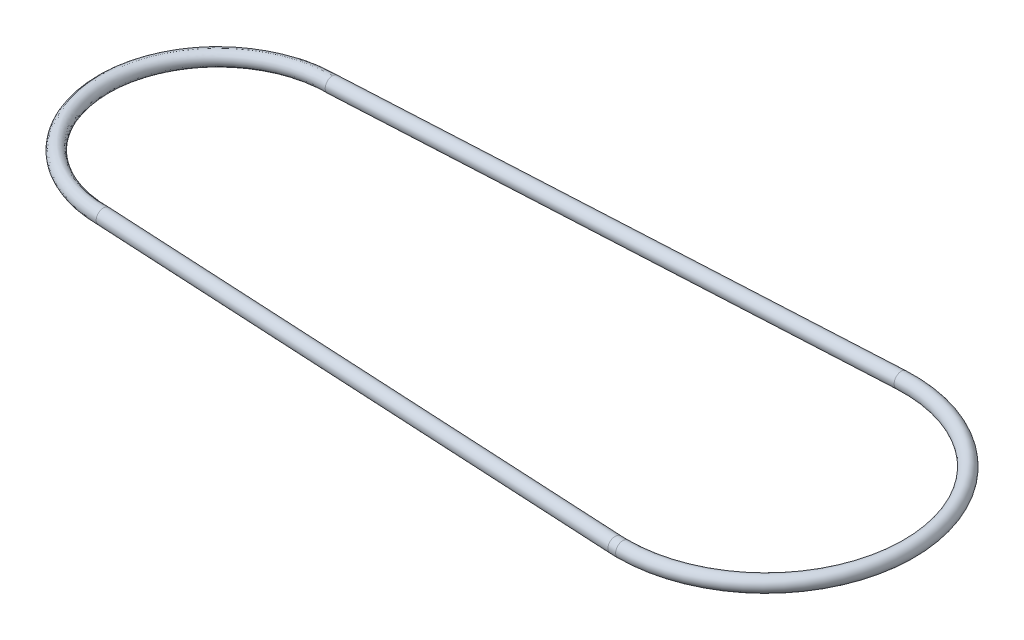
ISO-10303-21;
HEADER;
FILE_DESCRIPTION(('STEP AP214'),'2;1');
FILE_NAME('part.step','',(''),(''),'','','');
FILE_SCHEMA(('AUTOMOTIVE_DESIGN { 1 0 10303 214 1 1 1 1 }'));
ENDSEC;
DATA;
#1=APPLICATION_CONTEXT('core data for automotive mechanical design processes');
#2=APPLICATION_PROTOCOL_DEFINITION('international standard','automotive_design',2000,#1);
#3=PRODUCT_CONTEXT('',#1,'mechanical');
#4=PRODUCT('Part','Part','',(#3));
#5=PRODUCT_RELATED_PRODUCT_CATEGORY('part','',(#4));
#6=PRODUCT_DEFINITION_FORMATION('','',#4);
#7=PRODUCT_DEFINITION_CONTEXT('part definition',#1,'design');
#8=PRODUCT_DEFINITION('design','',#6,#7);
#9=PRODUCT_DEFINITION_SHAPE('','',#8);
#10=(LENGTH_UNIT() NAMED_UNIT(*) SI_UNIT(.MILLI.,.METRE.));
#11=(NAMED_UNIT(*) PLANE_ANGLE_UNIT() SI_UNIT($,.RADIAN.));
#12=(NAMED_UNIT(*) SI_UNIT($,.STERADIAN.) SOLID_ANGLE_UNIT());
#13=UNCERTAINTY_MEASURE_WITH_UNIT(LENGTH_MEASURE(1.E-05),#10,'distance_accuracy_value','');
#14=(GEOMETRIC_REPRESENTATION_CONTEXT(3) GLOBAL_UNCERTAINTY_ASSIGNED_CONTEXT((#13)) GLOBAL_UNIT_ASSIGNED_CONTEXT((#10,
#11,#12)) REPRESENTATION_CONTEXT('',''));
#15=CARTESIAN_POINT('',(0.,0.,0.));
#16=DIRECTION('',(0.,0.,1.));
#17=DIRECTION('',(1.,0.,0.));
#18=AXIS2_PLACEMENT_3D('',#15,#16,#17);
#19=CARTESIAN_POINT('',(0.,0.,0.));
#20=DIRECTION('',(0.,-1.,0.));
#21=DIRECTION('',(0.,0.,-1.));
#22=AXIS2_PLACEMENT_3D('',#19,#20,#21);
#23=TOROIDAL_SURFACE('',#22,30.,1.524);
#24=CARTESIAN_POINT('',(0.,0.,30.));
#25=DIRECTION('',(1.,0.,0.));
#26=DIRECTION('',(0.,0.,-1.));
#27=AXIS2_PLACEMENT_3D('',#24,#25,#26);
#28=CIRCLE('',#27,1.524);
#29=CARTESIAN_POINT('',(0.,0.,31.524));
#30=VERTEX_POINT('',#29);
#31=EDGE_CURVE('E123',#30,#30,#28,.T.);
#32=CARTESIAN_POINT('',(-1.57383887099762,0.,29.9586887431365));
#33=DIRECTION('',(0.998622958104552,0.,0.0524612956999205));
#34=DIRECTION('',(0.0524612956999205,0.,-0.998622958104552));
#35=AXIS2_PLACEMENT_3D('',#32,#33,#34);
#36=CIRCLE('',#35,1.524);
#37=CARTESIAN_POINT('',(-1.65378988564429,0.,31.4805901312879));
#38=VERTEX_POINT('',#37);
#39=EDGE_CURVE('E102',#38,#38,#36,.T.);
#40=CARTESIAN_POINT('',(0.,0.,0.));
#41=DIRECTION('',(0.,-1.,0.));
#42=DIRECTION('',(0.,0.,-1.));
#43=AXIS2_PLACEMENT_3D('',#40,#41,#42);
#44=CIRCLE('',#43,31.524);
#45=EDGE_CURVE('',#30,#38,#44,.T.);
#46=ORIENTED_EDGE('',*,*,#31,.F.);
#47=ORIENTED_EDGE('',*,*,#39,.T.);
#48=ORIENTED_EDGE('',*,*,#45,.T.);
#49=ORIENTED_EDGE('',*,*,#45,.F.);
#50=EDGE_LOOP('',(#46,#48,#47,#49));
#51=FACE_BOUND('',#50,.T.);
#52=ADVANCED_FACE('F36',(#51),#23,.T.);
#53=CARTESIAN_POINT('',(-1.57383887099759,0.,29.9586887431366));
#54=DIRECTION('',(-0.998622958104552,0.,-0.0524612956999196));
#55=DIRECTION('',(-0.0524612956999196,0.,0.998622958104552));
#56=AXIS2_PLACEMENT_3D('',#53,#54,#55);
#57=CYLINDRICAL_SURFACE('',#56,1.524);
#58=CARTESIAN_POINT('',(-115.,-1.524,24.0000000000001));
#59=CARTESIAN_POINT('',(-114.999701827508,-1.52400091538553,23.9886427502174));
#60=CARTESIAN_POINT('',(-114.999403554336,-1.52387376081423,23.977281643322));
#61=CARTESIAN_POINT('',(-114.996860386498,-1.5217008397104,23.8804132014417));
#62=CARTESIAN_POINT('',(-114.994615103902,-1.51254952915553,23.7948898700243));
#63=CARTESIAN_POINT('',(-114.991303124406,-1.48818404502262,23.6687341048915));
#64=CARTESIAN_POINT('',(-114.990206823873,-1.47826580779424,23.6269749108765));
#65=CARTESIAN_POINT('',(-114.988038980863,-1.45493765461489,23.5443990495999));
#66=CARTESIAN_POINT('',(-114.986967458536,-1.44152499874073,23.5035831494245));
#67=CARTESIAN_POINT('',(-114.983807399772,-1.39623705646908,23.383211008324));
#68=CARTESIAN_POINT('',(-114.981767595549,-1.35926904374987,23.3055103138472));
#69=CARTESIAN_POINT('',(-114.977880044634,-1.27278905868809,23.1574232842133));
#70=CARTESIAN_POINT('',(-114.976032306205,-1.22327654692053,23.0870372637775));
#71=CARTESIAN_POINT('',(-114.973445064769,-1.14072256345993,22.9884804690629));
#72=CARTESIAN_POINT('',(-114.972612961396,-1.11180504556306,22.9567826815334));
#73=CARTESIAN_POINT('',(-114.971016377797,-1.05143339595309,22.8959628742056));
#74=CARTESIAN_POINT('',(-114.970251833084,-1.01998173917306,22.8668383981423));
#75=CARTESIAN_POINT('',(-114.968066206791,-0.922075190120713,22.783579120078));
#76=CARTESIAN_POINT('',(-114.96675262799,-0.852052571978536,22.7335392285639));
#77=CARTESIAN_POINT('',(-114.964453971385,-0.70465731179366,22.6459730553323));
#78=CARTESIAN_POINT('',(-114.963468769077,-0.627287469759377,22.6084420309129));
#79=CARTESIAN_POINT('',(-114.961853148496,-0.467333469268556,22.546895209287));
#80=CARTESIAN_POINT('',(-114.961222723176,-0.384749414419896,22.5228791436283));
#81=CARTESIAN_POINT('',(-114.960334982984,-0.216746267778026,22.489060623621));
#82=CARTESIAN_POINT('',(-114.960077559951,-0.131328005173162,22.4792540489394));
#83=CARTESIAN_POINT('',(-114.959942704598,0.0399430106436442,22.4741167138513));
#84=CARTESIAN_POINT('',(-114.960065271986,0.12579576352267,22.4787859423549));
#85=CARTESIAN_POINT('',(-114.960686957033,0.295487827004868,22.5024691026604));
#86=CARTESIAN_POINT('',(-114.961186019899,0.379327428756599,22.5214809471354));
#87=CARTESIAN_POINT('',(-114.962546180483,0.542616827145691,22.5732961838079));
#88=CARTESIAN_POINT('',(-114.963407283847,0.622066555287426,22.6060997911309));
#89=CARTESIAN_POINT('',(-114.965468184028,0.774372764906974,22.6846090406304));
#90=CARTESIAN_POINT('',(-114.966668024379,0.847228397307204,22.7303163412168));
#91=CARTESIAN_POINT('',(-114.968693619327,0.949900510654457,22.8074797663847));
#92=CARTESIAN_POINT('',(-114.969406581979,0.98302718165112,22.8346394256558));
#93=CARTESIAN_POINT('',(-114.970903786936,1.04691141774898,22.8916738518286));
#94=CARTESIAN_POINT('',(-114.971688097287,1.07766666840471,22.9215512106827));
#95=CARTESIAN_POINT('',(-114.974139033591,1.16598170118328,23.0149162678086));
#96=CARTESIAN_POINT('',(-114.975904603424,1.21963824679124,23.0821727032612));
#97=CARTESIAN_POINT('',(-114.979647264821,1.31487621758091,23.2247415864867));
#98=CARTESIAN_POINT('',(-114.981624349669,1.35645802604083,23.3000537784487));
#99=CARTESIAN_POINT('',(-114.984706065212,1.40891800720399,23.4174427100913));
#100=CARTESIAN_POINT('',(-114.985754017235,1.42476595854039,23.457361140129));
#101=CARTESIAN_POINT('',(-114.987880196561,1.45302987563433,23.5383507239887));
#102=CARTESIAN_POINT('',(-114.988958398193,1.46544865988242,23.5794209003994));
#103=CARTESIAN_POINT('',(-114.992224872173,1.49738690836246,23.703844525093));
#104=CARTESIAN_POINT('',(-114.994450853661,1.51168745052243,23.7886335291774));
#105=CARTESIAN_POINT('',(-114.997493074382,1.5213183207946,23.9045119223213));
#106=CARTESIAN_POINT('',(-114.99829888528,1.52293249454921,23.9352051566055));
#107=CARTESIAN_POINT('',(-114.999403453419,1.52387272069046,23.9772777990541));
#108=CARTESIAN_POINT('',(-114.999701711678,1.52399968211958,23.9886383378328));
#109=CARTESIAN_POINT('',(-115.,1.524,24.));
#110=B_SPLINE_CURVE_WITH_KNOTS('',3,(#58,#59,#60,#61,#62,#63,#64,#65,#66,#67,#68,#69,#70,#71,
#72,#73,#74,#75,#76,#77,#78,#79,#80,#81,#82,#83,#84,#85,#86,#87,#88,#89,#90,#91,#92,#93,#94,#95,
#96,#97,#98,#99,#100,#101,#102,#103,#104,#105,#106,#107,#108,#109),.UNSPECIFIED.,.F.,.F.,(4,2,2,
2,2,2,2,2,2,2,2,2,2,2,2,2,2,2,2,2,2,2,2,2,2,4),(0.,0.0340936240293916,0.290685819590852,
0.419375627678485,0.548166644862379,0.805084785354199,1.06201397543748,1.19062374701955,
1.31910940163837,1.57600630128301,1.83280568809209,2.08959997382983,2.34631978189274,
2.60303939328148,2.85972165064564,3.1164079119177,3.37312717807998,3.50152576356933,
3.6300481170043,3.88691677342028,4.14377727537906,4.27252574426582,4.40116807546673,
4.65773054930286,4.74993254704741,4.78402617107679),.UNSPECIFIED.);
#111=CARTESIAN_POINT('',(-115.,-1.524,24.0000000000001));
#112=VERTEX_POINT('',#111);
#113=CARTESIAN_POINT('',(-115.,1.524,24.));
#114=VERTEX_POINT('',#113);
#115=EDGE_CURVE('E45',#112,#114,#110,.T.);
#116=ORIENTED_EDGE('',*,*,#115,.T.);
#117=CARTESIAN_POINT('',(-115.,-1.524,24.0000000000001));
#118=CARTESIAN_POINT('',(-115.000298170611,-1.52400091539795,24.0113572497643));
#119=CARTESIAN_POINT('',(-115.000596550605,-1.52387376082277,24.0227183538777));
#120=CARTESIAN_POINT('',(-115.003141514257,-1.52170086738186,24.1195854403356));
#121=CARTESIAN_POINT('',(-115.005394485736,-1.51254979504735,24.2051072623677));
#122=CARTESIAN_POINT('',(-115.008726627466,-1.48818486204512,24.3312605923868));
#123=CARTESIAN_POINT('',(-115.009831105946,-1.47826684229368,24.3730189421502));
#124=CARTESIAN_POINT('',(-115.012017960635,-1.45493917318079,24.4555930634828));
#125=CARTESIAN_POINT('',(-115.013100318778,-1.44152678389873,24.4964080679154));
#126=CARTESIAN_POINT('',(-115.016296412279,-1.39623967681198,24.6167775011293));
#127=CARTESIAN_POINT('',(-115.018364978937,-1.3592722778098,24.6944763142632));
#128=CARTESIAN_POINT('',(-115.022316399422,-1.27279360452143,24.8425594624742));
#129=CARTESIAN_POINT('',(-115.024199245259,-1.22328179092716,24.9129434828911));
#130=CARTESIAN_POINT('',(-115.02684089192,-1.1407291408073,25.0114970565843));
#131=CARTESIAN_POINT('',(-115.027691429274,-1.11181223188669,25.0431936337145));
#132=CARTESIAN_POINT('',(-115.029324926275,-1.05144187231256,25.1040110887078));
#133=CARTESIAN_POINT('',(-115.030107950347,-1.01999089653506,25.1331344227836));
#134=CARTESIAN_POINT('',(-115.032348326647,-0.922086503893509,25.216390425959));
#135=CARTESIAN_POINT('',(-115.033697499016,-0.852065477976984,25.26642833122));
#136=CARTESIAN_POINT('',(-115.036061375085,-0.704672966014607,25.3539916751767));
#137=CARTESIAN_POINT('',(-115.037076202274,-0.627304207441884,25.39152173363));
#138=CARTESIAN_POINT('',(-115.038741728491,-0.467352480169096,25.4530673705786));
#139=CARTESIAN_POINT('',(-115.039392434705,-0.38476961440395,25.4770832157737));
#140=CARTESIAN_POINT('',(-115.040309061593,-0.216767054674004,25.5109026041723));
#141=CARTESIAN_POINT('',(-115.040575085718,-0.131348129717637,25.520709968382));
#142=CARTESIAN_POINT('',(-115.040714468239,0.0399243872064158,25.5258492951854));
#143=CARTESIAN_POINT('',(-115.040587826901,0.125777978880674,25.5211812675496));
#144=CARTESIAN_POINT('',(-115.039945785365,0.295472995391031,25.4975006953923));
#145=CARTESIAN_POINT('',(-115.039430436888,0.379314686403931,25.4784900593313));
#146=CARTESIAN_POINT('',(-115.038027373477,0.542608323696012,25.4266770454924));
#147=CARTESIAN_POINT('',(-115.037139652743,0.622060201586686,25.3938744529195));
#148=CARTESIAN_POINT('',(-115.035018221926,0.774370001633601,25.3153671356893));
#149=CARTESIAN_POINT('',(-115.033784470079,0.847227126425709,25.2696608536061));
#150=CARTESIAN_POINT('',(-115.031705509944,0.94990131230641,25.1924986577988));
#151=CARTESIAN_POINT('',(-115.030974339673,0.983028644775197,25.1653393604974));
#152=CARTESIAN_POINT('',(-115.029440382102,1.04691412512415,25.1083055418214));
#153=CARTESIAN_POINT('',(-115.028637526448,1.07766995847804,25.0784284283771));
#154=CARTESIAN_POINT('',(-115.026131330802,1.16598452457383,24.9850660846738));
#155=CARTESIAN_POINT('',(-115.024329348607,1.21964022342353,24.9178122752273));
#156=CARTESIAN_POINT('',(-115.020518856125,1.31487677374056,24.7752486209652));
#157=CARTESIAN_POINT('',(-115.018510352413,1.35645800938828,24.6999390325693));
#158=CARTESIAN_POINT('',(-115.015387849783,1.40891735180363,24.5825539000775));
#159=CARTESIAN_POINT('',(-115.014327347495,1.42476512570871,24.5426367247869));
#160=CARTESIAN_POINT('',(-115.012178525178,1.45302877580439,24.46164959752));
#161=CARTESIAN_POINT('',(-115.011090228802,1.46544747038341,24.420580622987));
#162=CARTESIAN_POINT('',(-115.007797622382,1.49738560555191,24.2961604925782));
#163=CARTESIAN_POINT('',(-115.005559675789,1.51168627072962,24.2113736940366));
#164=CARTESIAN_POINT('',(-115.002509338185,1.52131798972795,24.0954942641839));
#165=CARTESIAN_POINT('',(-115.001702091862,1.52293242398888,24.0647979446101));
#166=CARTESIAN_POINT('',(-115.000596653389,1.52387272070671,24.0227221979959));
#167=CARTESIAN_POINT('',(-115.000298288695,1.5239996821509,24.0113616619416));
#168=CARTESIAN_POINT('',(-115.,1.524,24.));
#169=B_SPLINE_CURVE_WITH_KNOTS('',3,(#117,#118,#119,#120,#121,#122,#123,#124,#125,#126,#127,
#128,#129,#130,#131,#132,#133,#134,#135,#136,#137,#138,#139,#140,#141,#142,#143,#144,#145,#146,
#147,#148,#149,#150,#151,#152,#153,#154,#155,#156,#157,#158,#159,#160,#161,#162,#163,#164,#165,
#166,#167,#168),.UNSPECIFIED.,.F.,.F.,(4,2,2,2,2,2,2,2,2,2,2,2,2,2,2,2,2,2,2,2,2,2,2,2,2,4),(0.,
0.0340936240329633,0.290681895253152,0.41936971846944,0.548158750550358,0.805073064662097,
1.06199842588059,1.1906053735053,1.31908820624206,1.57597947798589,1.83277576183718,
2.08956697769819,2.34628912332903,2.6030110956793,2.859698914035,3.11639073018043,
3.37311354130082,3.50151388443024,3.63003799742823,3.8869012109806,4.14375625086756,
4.27250195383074,4.40114152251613,4.65769854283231,4.74990991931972,4.78400354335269),.UNSPECIFIED.);
#170=EDGE_CURVE('E11',#112,#114,#169,.T.);
#171=ORIENTED_EDGE('',*,*,#170,.F.);
#172=EDGE_LOOP('',(#116,#171));
#173=FACE_BOUND('',#172,.T.);
#174=ORIENTED_EDGE('',*,*,#39,.F.);
#175=EDGE_LOOP('',(#174));
#176=FACE_BOUND('',#175,.T.);
#177=ADVANCED_FACE('F108',(#173,#176),#57,.T.);
#178=CARTESIAN_POINT('',(0.,0.,0.));
#179=DIRECTION('',(0.,-1.,0.));
#180=DIRECTION('',(0.,0.,-1.));
#181=AXIS2_PLACEMENT_3D('',#178,#179,#180);
#182=TOROIDAL_SURFACE('',#181,30.,1.524);
#183=CARTESIAN_POINT('',(-1.57383887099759,0.,-29.9586887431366));
#184=DIRECTION('',(-0.998622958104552,0.,0.0524612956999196));
#185=DIRECTION('',(0.0524612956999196,0.,0.998622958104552));
#186=AXIS2_PLACEMENT_3D('',#183,#184,#185);
#187=CIRCLE('',#186,1.524);
#188=CARTESIAN_POINT('',(-1.65378988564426,0.,-31.4805901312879));
#189=VERTEX_POINT('',#188);
#190=EDGE_CURVE('E40',#189,#189,#187,.T.);
#191=CARTESIAN_POINT('',(0.,0.,0.));
#192=DIRECTION('',(0.,-1.,0.));
#193=DIRECTION('',(0.,0.,-1.));
#194=AXIS2_PLACEMENT_3D('',#191,#192,#193);
#195=CIRCLE('',#194,31.524);
#196=EDGE_CURVE('',#189,#30,#195,.T.);
#197=ORIENTED_EDGE('',*,*,#190,.F.);
#198=ORIENTED_EDGE('',*,*,#31,.T.);
#199=ORIENTED_EDGE('',*,*,#196,.T.);
#200=ORIENTED_EDGE('',*,*,#196,.F.);
#201=EDGE_LOOP('',(#197,#199,#198,#200));
#202=FACE_BOUND('',#201,.T.);
#203=ADVANCED_FACE('F111',(#202),#182,.T.);
#204=CARTESIAN_POINT('',(-115.199724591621,0.,-23.98950774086));
#205=DIRECTION('',(0.998622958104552,0.,-0.0524612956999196));
#206=DIRECTION('',(-0.0524612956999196,0.,-0.998622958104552));
#207=AXIS2_PLACEMENT_3D('',#204,#205,#206);
#208=CYLINDRICAL_SURFACE('',#207,1.524);
#209=CARTESIAN_POINT('',(-115.,1.524,-24.0000000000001));
#210=CARTESIAN_POINT('',(-114.999701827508,1.52400091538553,-23.9886427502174));
#211=CARTESIAN_POINT('',(-114.999403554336,1.52387376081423,-23.977281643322));
#212=CARTESIAN_POINT('',(-114.996860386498,1.52170083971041,-23.8804132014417));
#213=CARTESIAN_POINT('',(-114.994615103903,1.51254952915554,-23.7948898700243));
#214=CARTESIAN_POINT('',(-114.991303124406,1.48818404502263,-23.6687341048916));
#215=CARTESIAN_POINT('',(-114.990206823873,1.47826580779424,-23.6269749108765));
#216=CARTESIAN_POINT('',(-114.988038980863,1.45493765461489,-23.5443990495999));
#217=CARTESIAN_POINT('',(-114.986967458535,1.44152499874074,-23.5035831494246));
#218=CARTESIAN_POINT('',(-114.983807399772,1.39623705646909,-23.383211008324));
#219=CARTESIAN_POINT('',(-114.981767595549,1.3592690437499,-23.3055103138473));
#220=CARTESIAN_POINT('',(-114.977880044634,1.27278905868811,-23.1574232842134));
#221=CARTESIAN_POINT('',(-114.976032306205,1.22327654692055,-23.0870372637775));
#222=CARTESIAN_POINT('',(-114.973445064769,1.14072256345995,-22.9884804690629));
#223=CARTESIAN_POINT('',(-114.972612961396,1.11180504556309,-22.9567826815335));
#224=CARTESIAN_POINT('',(-114.971016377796,1.05143339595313,-22.8959628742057));
#225=CARTESIAN_POINT('',(-114.970251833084,1.0199817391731,-22.8668383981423));
#226=CARTESIAN_POINT('',(-114.968066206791,0.922075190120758,-22.7835791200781));
#227=CARTESIAN_POINT('',(-114.96675262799,0.852052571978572,-22.733539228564));
#228=CARTESIAN_POINT('',(-114.964453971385,0.704657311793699,-22.6459730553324));
#229=CARTESIAN_POINT('',(-114.963468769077,0.62728746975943,-22.608442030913));
#230=CARTESIAN_POINT('',(-114.961853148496,0.467333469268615,-22.546895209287));
#231=CARTESIAN_POINT('',(-114.961222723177,0.38474941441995,-22.5228791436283));
#232=CARTESIAN_POINT('',(-114.960334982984,0.216746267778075,-22.489060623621));
#233=CARTESIAN_POINT('',(-114.960077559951,0.131328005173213,-22.4792540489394));
#234=CARTESIAN_POINT('',(-114.959942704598,-0.0399430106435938,-22.4741167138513));
#235=CARTESIAN_POINT('',(-114.960065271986,-0.125795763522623,-22.4787859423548));
#236=CARTESIAN_POINT('',(-114.960686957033,-0.295487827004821,-22.5024691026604));
#237=CARTESIAN_POINT('',(-114.961186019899,-0.379327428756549,-22.5214809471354));
#238=CARTESIAN_POINT('',(-114.962546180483,-0.542616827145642,-22.5732961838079));
#239=CARTESIAN_POINT('',(-114.963407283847,-0.622066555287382,-22.6060997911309));
#240=CARTESIAN_POINT('',(-114.965468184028,-0.774372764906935,-22.6846090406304));
#241=CARTESIAN_POINT('',(-114.966668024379,-0.847228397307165,-22.7303163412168));
#242=CARTESIAN_POINT('',(-114.968693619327,-0.949900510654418,-22.8074797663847));
#243=CARTESIAN_POINT('',(-114.969406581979,-0.983027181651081,-22.8346394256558));
#244=CARTESIAN_POINT('',(-114.970903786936,-1.04691141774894,-22.8916738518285));
#245=CARTESIAN_POINT('',(-114.971688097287,-1.07766666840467,-22.9215512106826));
#246=CARTESIAN_POINT('',(-114.974139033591,-1.16598170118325,-23.0149162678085));
#247=CARTESIAN_POINT('',(-114.975904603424,-1.21963824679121,-23.0821727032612));
#248=CARTESIAN_POINT('',(-114.979647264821,-1.31487621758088,-23.2247415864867));
#249=CARTESIAN_POINT('',(-114.981624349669,-1.35645802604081,-23.3000537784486));
#250=CARTESIAN_POINT('',(-114.984706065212,-1.40891800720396,-23.4174427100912));
#251=CARTESIAN_POINT('',(-114.985754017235,-1.42476595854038,-23.4573611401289));
#252=CARTESIAN_POINT('',(-114.987880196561,-1.45302987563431,-23.5383507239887));
#253=CARTESIAN_POINT('',(-114.988958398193,-1.46544865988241,-23.5794209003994));
#254=CARTESIAN_POINT('',(-114.992224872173,-1.49738690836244,-23.7038445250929));
#255=CARTESIAN_POINT('',(-114.994450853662,-1.51168745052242,-23.7886335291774));
#256=CARTESIAN_POINT('',(-114.997493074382,-1.52131832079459,-23.9045119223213));
#257=CARTESIAN_POINT('',(-114.99829888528,-1.52293249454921,-23.9352051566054));
#258=CARTESIAN_POINT('',(-114.999403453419,-1.52387272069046,-23.977277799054));
#259=CARTESIAN_POINT('',(-114.999701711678,-1.52399968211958,-23.9886383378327));
#260=CARTESIAN_POINT('',(-115.,-1.524,-23.9999999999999));
#261=B_SPLINE_CURVE_WITH_KNOTS('',3,(#209,#210,#211,#212,#213,#214,#215,#216,#217,#218,#219,
#220,#221,#222,#223,#224,#225,#226,#227,#228,#229,#230,#231,#232,#233,#234,#235,#236,#237,#238,
#239,#240,#241,#242,#243,#244,#245,#246,#247,#248,#249,#250,#251,#252,#253,#254,#255,#256,#257,
#258,#259,#260),.UNSPECIFIED.,.F.,.F.,(4,2,2,2,2,2,2,2,2,2,2,2,2,2,2,2,2,2,2,2,2,2,2,2,2,4),(0.,
0.0340936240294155,0.290685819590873,0.4193756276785,0.548166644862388,0.805084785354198,
1.06201397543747,1.19062374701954,1.31910940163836,1.57600630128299,1.83280568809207,
2.08959997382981,2.34631978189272,2.60303939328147,2.85972165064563,3.11640791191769,
3.37312717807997,3.50152576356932,3.63004811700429,3.88691677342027,4.14377727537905,
4.27252574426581,4.40116807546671,4.65773054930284,4.74993254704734,4.7840261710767),.UNSPECIFIED.);
#262=CARTESIAN_POINT('',(-115.,-1.524,-23.9999999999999));
#263=VERTEX_POINT('',#262);
#264=CARTESIAN_POINT('',(-115.,1.524,-24.0000000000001));
#265=VERTEX_POINT('',#264);
#266=EDGE_CURVE('E63',#263,#265,#261,.F.);
#267=ORIENTED_EDGE('',*,*,#266,.F.);
#268=CARTESIAN_POINT('',(-115.,1.524,-24.0000000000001));
#269=CARTESIAN_POINT('',(-115.000298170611,1.52400091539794,-24.0113572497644));
#270=CARTESIAN_POINT('',(-115.000596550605,1.52387376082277,-24.0227183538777));
#271=CARTESIAN_POINT('',(-115.003141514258,1.52170086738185,-24.1195854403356));
#272=CARTESIAN_POINT('',(-115.005394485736,1.51254979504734,-24.2051072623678));
#273=CARTESIAN_POINT('',(-115.008726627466,1.4881848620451,-24.3312605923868));
#274=CARTESIAN_POINT('',(-115.009831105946,1.47826684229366,-24.3730189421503));
#275=CARTESIAN_POINT('',(-115.012017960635,1.45493917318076,-24.4555930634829));
#276=CARTESIAN_POINT('',(-115.013100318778,1.44152678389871,-24.4964080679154));
#277=CARTESIAN_POINT('',(-115.016296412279,1.39623967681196,-24.6167775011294));
#278=CARTESIAN_POINT('',(-115.018364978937,1.35927227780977,-24.6944763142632));
#279=CARTESIAN_POINT('',(-115.022316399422,1.2727936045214,-24.8425594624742));
#280=CARTESIAN_POINT('',(-115.024199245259,1.22328179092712,-24.9129434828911));
#281=CARTESIAN_POINT('',(-115.02684089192,1.14072914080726,-25.0114970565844));
#282=CARTESIAN_POINT('',(-115.027691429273,1.11181223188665,-25.0431936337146));
#283=CARTESIAN_POINT('',(-115.029324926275,1.05144187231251,-25.1040110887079));
#284=CARTESIAN_POINT('',(-115.030107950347,1.01999089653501,-25.1331344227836));
#285=CARTESIAN_POINT('',(-115.032348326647,0.922086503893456,-25.216390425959));
#286=CARTESIAN_POINT('',(-115.033697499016,0.852065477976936,-25.26642833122));
#287=CARTESIAN_POINT('',(-115.036061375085,0.704672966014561,-25.3539916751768));
#288=CARTESIAN_POINT('',(-115.037076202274,0.627304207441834,-25.39152173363));
#289=CARTESIAN_POINT('',(-115.038741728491,0.467352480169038,-25.4530673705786));
#290=CARTESIAN_POINT('',(-115.039392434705,0.384769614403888,-25.4770832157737));
#291=CARTESIAN_POINT('',(-115.040309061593,0.216767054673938,-25.5109026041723));
#292=CARTESIAN_POINT('',(-115.040575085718,0.131348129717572,-25.520709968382));
#293=CARTESIAN_POINT('',(-115.04071446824,-0.0399243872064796,-25.5258492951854));
#294=CARTESIAN_POINT('',(-115.040587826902,-0.125777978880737,-25.5211812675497));
#295=CARTESIAN_POINT('',(-115.039945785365,-0.295472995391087,-25.4975006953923));
#296=CARTESIAN_POINT('',(-115.039430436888,-0.37931468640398,-25.4784900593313));
#297=CARTESIAN_POINT('',(-115.038027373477,-0.542608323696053,-25.4266770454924));
#298=CARTESIAN_POINT('',(-115.037139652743,-0.622060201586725,-25.3938744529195));
#299=CARTESIAN_POINT('',(-115.035018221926,-0.774370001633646,-25.3153671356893));
#300=CARTESIAN_POINT('',(-115.033784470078,-0.84722712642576,-25.2696608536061));
#301=CARTESIAN_POINT('',(-115.031705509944,-0.949901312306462,-25.1924986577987));
#302=CARTESIAN_POINT('',(-115.030974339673,-0.983028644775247,-25.1653393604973));
#303=CARTESIAN_POINT('',(-115.029440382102,-1.04691412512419,-25.1083055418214));
#304=CARTESIAN_POINT('',(-115.028637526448,-1.07766995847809,-25.078428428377));
#305=CARTESIAN_POINT('',(-115.026131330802,-1.16598452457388,-24.9850660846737));
#306=CARTESIAN_POINT('',(-115.024329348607,-1.21964022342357,-24.9178122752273));
#307=CARTESIAN_POINT('',(-115.020518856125,-1.31487677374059,-24.7752486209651));
#308=CARTESIAN_POINT('',(-115.018510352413,-1.35645800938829,-24.6999390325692));
#309=CARTESIAN_POINT('',(-115.015387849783,-1.40891735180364,-24.5825539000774));
#310=CARTESIAN_POINT('',(-115.014327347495,-1.42476512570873,-24.5426367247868));
#311=CARTESIAN_POINT('',(-115.012178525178,-1.45302877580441,-24.4616495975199));
#312=CARTESIAN_POINT('',(-115.011090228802,-1.46544747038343,-24.420580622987));
#313=CARTESIAN_POINT('',(-115.007797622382,-1.49738560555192,-24.2961604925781));
#314=CARTESIAN_POINT('',(-115.005559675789,-1.51168627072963,-24.2113736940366));
#315=CARTESIAN_POINT('',(-115.002509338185,-1.52131798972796,-24.0954942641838));
#316=CARTESIAN_POINT('',(-115.001702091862,-1.52293242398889,-24.06479794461));
#317=CARTESIAN_POINT('',(-115.000596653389,-1.52387272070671,-24.0227221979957));
#318=CARTESIAN_POINT('',(-115.000298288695,-1.5239996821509,-24.0113616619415));
#319=CARTESIAN_POINT('',(-115.,-1.524,-23.9999999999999));
#320=B_SPLINE_CURVE_WITH_KNOTS('',3,(#268,#269,#270,#271,#272,#273,#274,#275,#276,#277,#278,
#279,#280,#281,#282,#283,#284,#285,#286,#287,#288,#289,#290,#291,#292,#293,#294,#295,#296,#297,
#298,#299,#300,#301,#302,#303,#304,#305,#306,#307,#308,#309,#310,#311,#312,#313,#314,#315,#316,
#317,#318,#319),.UNSPECIFIED.,.F.,.F.,(4,2,2,2,2,2,2,2,2,2,2,2,2,2,2,2,2,2,2,2,2,2,2,2,2,4),(0.,
0.0340936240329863,0.290681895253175,0.419369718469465,0.548158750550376,0.805073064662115,
1.0619984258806,1.19060537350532,1.31908820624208,1.57597947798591,1.83277576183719,
2.0895669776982,2.34628912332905,2.60301109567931,2.85969891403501,3.11639073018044,
3.37311354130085,3.50151388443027,3.63003799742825,3.88690121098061,4.14375625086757,
4.27250195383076,4.40114152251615,4.65769854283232,4.74990991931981,4.78400354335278),.UNSPECIFIED.);
#321=EDGE_CURVE('E60',#263,#265,#320,.F.);
#322=ORIENTED_EDGE('',*,*,#321,.T.);
#323=EDGE_LOOP('',(#267,#322));
#324=FACE_BOUND('',#323,.T.);
#325=ORIENTED_EDGE('',*,*,#190,.T.);
#326=EDGE_LOOP('',(#325));
#327=FACE_BOUND('',#326,.T.);
#328=ADVANCED_FACE('F38',(#324,#327),#208,.T.);
#329=CARTESIAN_POINT('',(-114.8,0.,22.476));
#330=CARTESIAN_POINT('',(-114.866666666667,0.,22.476));
#331=CARTESIAN_POINT('',(-114.935450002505,0.,22.476000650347));
#332=CARTESIAN_POINT('',(-115.380299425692,0.,22.4759961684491));
#333=CARTESIAN_POINT('',(-115.735624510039,0.,22.4669690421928));
#334=CARTESIAN_POINT('',(-116.470307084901,0.,22.4308724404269));
#335=CARTESIAN_POINT('',(-116.837193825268,0.,22.403806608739));
#336=CARTESIAN_POINT('',(-117.935194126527,0.,22.295655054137));
#337=CARTESIAN_POINT('',(-118.663647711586,0.,22.187592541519));
#338=CARTESIAN_POINT('',(-120.827828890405,0.,21.7570906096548));
#339=CARTESIAN_POINT('',(-122.242119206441,0.,21.3280630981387));
#340=CARTESIAN_POINT('',(-126.319340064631,0.,19.6392229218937));
#341=CARTESIAN_POINT('',(-128.812552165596,0.,17.9733118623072));
#342=CARTESIAN_POINT('',(-132.973311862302,0.,13.8125521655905));
#343=CARTESIAN_POINT('',(-134.639222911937,0.,11.319340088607));
#344=CARTESIAN_POINT('',(-136.89100983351,0.,5.88304556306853));
#345=CARTESIAN_POINT('',(-137.476,0.,2.94210139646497));
#346=CARTESIAN_POINT('',(-137.476,0.,-2.94210139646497));
#347=CARTESIAN_POINT('',(-136.891009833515,0.,-5.88304556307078));
#348=CARTESIAN_POINT('',(-134.639222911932,0.,-11.3193400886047));
#349=CARTESIAN_POINT('',(-132.97331186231,0.,-13.8125521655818));
#350=CARTESIAN_POINT('',(-128.812552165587,0.,-17.9733118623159));
#351=CARTESIAN_POINT('',(-126.31934006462,0.,-19.6392229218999));
#352=CARTESIAN_POINT('',(-122.242119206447,0.,-21.3280630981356));
#353=CARTESIAN_POINT('',(-120.827828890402,0.,-21.7570906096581));
#354=CARTESIAN_POINT('',(-118.663647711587,0.,-22.1875925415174));
#355=CARTESIAN_POINT('',(-117.93519412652,0.,-22.2956550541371));
#356=CARTESIAN_POINT('',(-116.837193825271,0.,-22.4038066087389));
#357=CARTESIAN_POINT('',(-116.470307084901,0.,-22.4308724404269));
#358=CARTESIAN_POINT('',(-115.735624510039,0.,-22.4669690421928));
#359=CARTESIAN_POINT('',(-115.380299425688,0.,-22.4759961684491));
#360=CARTESIAN_POINT('',(-114.935450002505,0.,-22.476000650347));
#361=CARTESIAN_POINT('',(-114.866666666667,0.,-22.476));
#362=CARTESIAN_POINT('',(-114.8,0.,-22.476));
#363=CARTESIAN_POINT('',(-114.8,3.048,22.476));
#364=CARTESIAN_POINT('',(-114.866666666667,3.048,22.476));
#365=CARTESIAN_POINT('',(-114.935450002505,3.048,22.476000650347));
#366=CARTESIAN_POINT('',(-115.380299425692,3.048,22.4759961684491));
#367=CARTESIAN_POINT('',(-115.735624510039,3.048,22.4669690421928));
#368=CARTESIAN_POINT('',(-116.470307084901,3.048,22.4308724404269));
#369=CARTESIAN_POINT('',(-116.837193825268,3.048,22.403806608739));
#370=CARTESIAN_POINT('',(-117.935194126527,3.048,22.295655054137));
#371=CARTESIAN_POINT('',(-118.663647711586,3.048,22.187592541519));
#372=CARTESIAN_POINT('',(-120.827828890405,3.048,21.7570906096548));
#373=CARTESIAN_POINT('',(-122.242119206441,3.048,21.3280630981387));
#374=CARTESIAN_POINT('',(-126.319340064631,3.048,19.6392229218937));
#375=CARTESIAN_POINT('',(-128.812552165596,3.048,17.9733118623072));
#376=CARTESIAN_POINT('',(-132.973311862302,3.048,13.8125521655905));
#377=CARTESIAN_POINT('',(-134.639222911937,3.048,11.319340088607));
#378=CARTESIAN_POINT('',(-136.89100983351,3.048,5.88304556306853));
#379=CARTESIAN_POINT('',(-137.476,3.048,2.94210139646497));
#380=CARTESIAN_POINT('',(-137.476,3.048,-2.94210139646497));
#381=CARTESIAN_POINT('',(-136.891009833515,3.048,-5.88304556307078));
#382=CARTESIAN_POINT('',(-134.639222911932,3.048,-11.3193400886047));
#383=CARTESIAN_POINT('',(-132.97331186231,3.048,-13.8125521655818));
#384=CARTESIAN_POINT('',(-128.812552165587,3.048,-17.9733118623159));
#385=CARTESIAN_POINT('',(-126.31934006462,3.048,-19.6392229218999));
#386=CARTESIAN_POINT('',(-122.242119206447,3.048,-21.3280630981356));
#387=CARTESIAN_POINT('',(-120.827828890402,3.048,-21.7570906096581));
#388=CARTESIAN_POINT('',(-118.663647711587,3.048,-22.1875925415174));
#389=CARTESIAN_POINT('',(-117.93519412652,3.048,-22.2956550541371));
#390=CARTESIAN_POINT('',(-116.837193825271,3.048,-22.4038066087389));
#391=CARTESIAN_POINT('',(-116.470307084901,3.048,-22.4308724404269));
#392=CARTESIAN_POINT('',(-115.735624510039,3.048,-22.4669690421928));
#393=CARTESIAN_POINT('',(-115.380299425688,3.048,-22.4759961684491));
#394=CARTESIAN_POINT('',(-114.935450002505,3.048,-22.476000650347));
#395=CARTESIAN_POINT('',(-114.866666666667,3.048,-22.476));
#396=CARTESIAN_POINT('',(-114.8,3.048,-22.476));
#397=CARTESIAN_POINT('',(-114.8,3.048,25.524));
#398=CARTESIAN_POINT('',(-114.866666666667,3.048,25.524));
#399=CARTESIAN_POINT('',(-114.931216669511,3.048,25.5240007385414));
#400=CARTESIAN_POINT('',(-115.40524031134,3.048,25.5239956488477));
#401=CARTESIAN_POINT('',(-115.835383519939,3.048,25.5137443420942));
#402=CARTESIAN_POINT('',(-116.669697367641,3.048,25.4727526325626));
#403=CARTESIAN_POINT('',(-117.086338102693,3.048,25.4420163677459));
#404=CARTESIAN_POINT('',(-118.333239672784,3.048,25.3191982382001));
#405=CARTESIAN_POINT('',(-119.160479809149,3.048,25.1964812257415));
#406=CARTESIAN_POINT('',(-121.618148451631,3.048,24.7075983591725));
#407=CARTESIAN_POINT('',(-123.224232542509,3.048,24.220389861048));
#408=CARTESIAN_POINT('',(-127.854370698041,3.048,22.3025238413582));
#409=CARTESIAN_POINT('',(-130.685690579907,3.048,20.4106963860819));
#410=CARTESIAN_POINT('',(-135.410696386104,3.048,15.685690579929));
#411=CARTESIAN_POINT('',(-137.302523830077,3.048,12.8543707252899));
#412=CARTESIAN_POINT('',(-139.859678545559,3.048,6.68085313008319));
#413=CARTESIAN_POINT('',(-140.524,3.048,3.34108364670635));
#414=CARTESIAN_POINT('',(-140.524,3.048,-3.34108364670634));
#415=CARTESIAN_POINT('',(-139.859678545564,3.048,-6.68085313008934));
#416=CARTESIAN_POINT('',(-137.302523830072,3.048,-12.8543707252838));
#417=CARTESIAN_POINT('',(-135.410696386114,3.048,-15.6856905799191));
#418=CARTESIAN_POINT('',(-130.685690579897,3.048,-20.4106963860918));
#419=CARTESIAN_POINT('',(-127.854370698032,3.048,-22.3025238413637));
#420=CARTESIAN_POINT('',(-123.224232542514,3.048,-24.2203898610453));
#421=CARTESIAN_POINT('',(-121.618148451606,3.048,-24.7075983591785));
#422=CARTESIAN_POINT('',(-119.160479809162,3.048,-25.1964812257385));
#423=CARTESIAN_POINT('',(-118.333239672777,3.048,-25.3191982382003));
#424=CARTESIAN_POINT('',(-117.086338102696,3.048,-25.4420163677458));
#425=CARTESIAN_POINT('',(-116.669697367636,3.048,-25.4727526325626));
#426=CARTESIAN_POINT('',(-115.835383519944,3.048,-25.5137443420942));
#427=CARTESIAN_POINT('',(-115.405240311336,3.048,-25.5239956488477));
#428=CARTESIAN_POINT('',(-114.931216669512,3.048,-25.5240007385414));
#429=CARTESIAN_POINT('',(-114.866666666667,3.048,-25.524));
#430=CARTESIAN_POINT('',(-114.8,3.048,-25.524));
#431=CARTESIAN_POINT('',(-114.8,0.,25.524));
#432=CARTESIAN_POINT('',(-114.866666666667,0.,25.524));
#433=CARTESIAN_POINT('',(-114.931216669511,0.,25.5240007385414));
#434=CARTESIAN_POINT('',(-115.40524031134,0.,25.5239956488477));
#435=CARTESIAN_POINT('',(-115.835383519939,0.,25.5137443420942));
#436=CARTESIAN_POINT('',(-116.669697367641,0.,25.4727526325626));
#437=CARTESIAN_POINT('',(-117.086338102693,0.,25.4420163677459));
#438=CARTESIAN_POINT('',(-118.333239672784,0.,25.3191982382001));
#439=CARTESIAN_POINT('',(-119.160479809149,0.,25.1964812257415));
#440=CARTESIAN_POINT('',(-121.618148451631,0.,24.7075983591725));
#441=CARTESIAN_POINT('',(-123.224232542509,0.,24.220389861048));
#442=CARTESIAN_POINT('',(-127.854370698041,0.,22.3025238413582));
#443=CARTESIAN_POINT('',(-130.685690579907,0.,20.4106963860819));
#444=CARTESIAN_POINT('',(-135.410696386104,0.,15.685690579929));
#445=CARTESIAN_POINT('',(-137.302523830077,0.,12.8543707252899));
#446=CARTESIAN_POINT('',(-139.859678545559,0.,6.68085313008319));
#447=CARTESIAN_POINT('',(-140.524,0.,3.34108364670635));
#448=CARTESIAN_POINT('',(-140.524,0.,-3.34108364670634));
#449=CARTESIAN_POINT('',(-139.859678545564,0.,-6.68085313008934));
#450=CARTESIAN_POINT('',(-137.302523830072,0.,-12.8543707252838));
#451=CARTESIAN_POINT('',(-135.410696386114,0.,-15.6856905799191));
#452=CARTESIAN_POINT('',(-130.685690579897,0.,-20.4106963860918));
#453=CARTESIAN_POINT('',(-127.854370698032,0.,-22.3025238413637));
#454=CARTESIAN_POINT('',(-123.224232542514,0.,-24.2203898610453));
#455=CARTESIAN_POINT('',(-121.618148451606,0.,-24.7075983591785));
#456=CARTESIAN_POINT('',(-119.160479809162,0.,-25.1964812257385));
#457=CARTESIAN_POINT('',(-118.333239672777,0.,-25.3191982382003));
#458=CARTESIAN_POINT('',(-117.086338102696,0.,-25.4420163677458));
#459=CARTESIAN_POINT('',(-116.669697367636,0.,-25.4727526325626));
#460=CARTESIAN_POINT('',(-115.835383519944,0.,-25.5137443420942));
#461=CARTESIAN_POINT('',(-115.405240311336,0.,-25.5239956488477));
#462=CARTESIAN_POINT('',(-114.931216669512,0.,-25.5240007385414));
#463=CARTESIAN_POINT('',(-114.866666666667,0.,-25.524));
#464=CARTESIAN_POINT('',(-114.8,0.,-25.524));
#465=CARTESIAN_POINT('',(-114.8,-3.048,25.524));
#466=CARTESIAN_POINT('',(-114.866666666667,-3.048,25.524));
#467=CARTESIAN_POINT('',(-114.931216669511,-3.048,25.5240007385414));
#468=CARTESIAN_POINT('',(-115.40524031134,-3.048,25.5239956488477));
#469=CARTESIAN_POINT('',(-115.835383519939,-3.048,25.5137443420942));
#470=CARTESIAN_POINT('',(-116.669697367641,-3.048,25.4727526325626));
#471=CARTESIAN_POINT('',(-117.086338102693,-3.048,25.4420163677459));
#472=CARTESIAN_POINT('',(-118.333239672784,-3.048,25.3191982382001));
#473=CARTESIAN_POINT('',(-119.160479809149,-3.048,25.1964812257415));
#474=CARTESIAN_POINT('',(-121.618148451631,-3.048,24.7075983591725));
#475=CARTESIAN_POINT('',(-123.224232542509,-3.048,24.220389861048));
#476=CARTESIAN_POINT('',(-127.854370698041,-3.048,22.3025238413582));
#477=CARTESIAN_POINT('',(-130.685690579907,-3.048,20.4106963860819));
#478=CARTESIAN_POINT('',(-135.410696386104,-3.048,15.685690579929));
#479=CARTESIAN_POINT('',(-137.302523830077,-3.048,12.8543707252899));
#480=CARTESIAN_POINT('',(-139.859678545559,-3.048,6.68085313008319));
#481=CARTESIAN_POINT('',(-140.524,-3.048,3.34108364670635));
#482=CARTESIAN_POINT('',(-140.524,-3.048,-3.34108364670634));
#483=CARTESIAN_POINT('',(-139.859678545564,-3.048,-6.68085313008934));
#484=CARTESIAN_POINT('',(-137.302523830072,-3.048,-12.8543707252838));
#485=CARTESIAN_POINT('',(-135.410696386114,-3.048,-15.6856905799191));
#486=CARTESIAN_POINT('',(-130.685690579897,-3.048,-20.4106963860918));
#487=CARTESIAN_POINT('',(-127.854370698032,-3.048,-22.3025238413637));
#488=CARTESIAN_POINT('',(-123.224232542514,-3.048,-24.2203898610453));
#489=CARTESIAN_POINT('',(-121.618148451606,-3.048,-24.7075983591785));
#490=CARTESIAN_POINT('',(-119.160479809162,-3.048,-25.1964812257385));
#491=CARTESIAN_POINT('',(-118.333239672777,-3.048,-25.3191982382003));
#492=CARTESIAN_POINT('',(-117.086338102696,-3.048,-25.4420163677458));
#493=CARTESIAN_POINT('',(-116.669697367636,-3.048,-25.4727526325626));
#494=CARTESIAN_POINT('',(-115.835383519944,-3.048,-25.5137443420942));
#495=CARTESIAN_POINT('',(-115.405240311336,-3.048,-25.5239956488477));
#496=CARTESIAN_POINT('',(-114.931216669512,-3.048,-25.5240007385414));
#497=CARTESIAN_POINT('',(-114.866666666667,-3.048,-25.524));
#498=CARTESIAN_POINT('',(-114.8,-3.048,-25.524));
#499=CARTESIAN_POINT('',(-114.8,-3.048,22.476));
#500=CARTESIAN_POINT('',(-114.866666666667,-3.048,22.476));
#501=CARTESIAN_POINT('',(-114.935450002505,-3.048,22.476000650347));
#502=CARTESIAN_POINT('',(-115.380299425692,-3.048,22.4759961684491));
#503=CARTESIAN_POINT('',(-115.735624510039,-3.048,22.4669690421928));
#504=CARTESIAN_POINT('',(-116.470307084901,-3.048,22.4308724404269));
#505=CARTESIAN_POINT('',(-116.837193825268,-3.048,22.403806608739));
#506=CARTESIAN_POINT('',(-117.935194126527,-3.048,22.295655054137));
#507=CARTESIAN_POINT('',(-118.663647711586,-3.048,22.187592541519));
#508=CARTESIAN_POINT('',(-120.827828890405,-3.048,21.7570906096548));
#509=CARTESIAN_POINT('',(-122.242119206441,-3.048,21.3280630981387));
#510=CARTESIAN_POINT('',(-126.319340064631,-3.048,19.6392229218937));
#511=CARTESIAN_POINT('',(-128.812552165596,-3.048,17.9733118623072));
#512=CARTESIAN_POINT('',(-132.973311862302,-3.048,13.8125521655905));
#513=CARTESIAN_POINT('',(-134.639222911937,-3.048,11.319340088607));
#514=CARTESIAN_POINT('',(-136.89100983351,-3.048,5.88304556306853));
#515=CARTESIAN_POINT('',(-137.476,-3.048,2.94210139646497));
#516=CARTESIAN_POINT('',(-137.476,-3.048,-2.94210139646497));
#517=CARTESIAN_POINT('',(-136.891009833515,-3.048,-5.88304556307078));
#518=CARTESIAN_POINT('',(-134.639222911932,-3.048,-11.3193400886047));
#519=CARTESIAN_POINT('',(-132.97331186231,-3.048,-13.8125521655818));
#520=CARTESIAN_POINT('',(-128.812552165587,-3.048,-17.9733118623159));
#521=CARTESIAN_POINT('',(-126.31934006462,-3.048,-19.6392229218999));
#522=CARTESIAN_POINT('',(-122.242119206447,-3.048,-21.3280630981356));
#523=CARTESIAN_POINT('',(-120.827828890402,-3.048,-21.7570906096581));
#524=CARTESIAN_POINT('',(-118.663647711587,-3.048,-22.1875925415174));
#525=CARTESIAN_POINT('',(-117.93519412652,-3.048,-22.2956550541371));
#526=CARTESIAN_POINT('',(-116.837193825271,-3.048,-22.4038066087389));
#527=CARTESIAN_POINT('',(-116.470307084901,-3.048,-22.4308724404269));
#528=CARTESIAN_POINT('',(-115.735624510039,-3.048,-22.4669690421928));
#529=CARTESIAN_POINT('',(-115.380299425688,-3.048,-22.4759961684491));
#530=CARTESIAN_POINT('',(-114.935450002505,-3.048,-22.476000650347));
#531=CARTESIAN_POINT('',(-114.866666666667,-3.048,-22.476));
#532=CARTESIAN_POINT('',(-114.8,-3.048,-22.476));
#533=CARTESIAN_POINT('',(-114.8,0.,22.476));
#534=CARTESIAN_POINT('',(-114.866666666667,0.,22.476));
#535=CARTESIAN_POINT('',(-114.935450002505,0.,22.476000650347));
#536=CARTESIAN_POINT('',(-115.380299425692,0.,22.4759961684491));
#537=CARTESIAN_POINT('',(-115.735624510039,0.,22.4669690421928));
#538=CARTESIAN_POINT('',(-116.470307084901,0.,22.4308724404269));
#539=CARTESIAN_POINT('',(-116.837193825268,0.,22.403806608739));
#540=CARTESIAN_POINT('',(-117.935194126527,0.,22.295655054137));
#541=CARTESIAN_POINT('',(-118.663647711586,0.,22.187592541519));
#542=CARTESIAN_POINT('',(-120.827828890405,0.,21.7570906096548));
#543=CARTESIAN_POINT('',(-122.242119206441,0.,21.3280630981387));
#544=CARTESIAN_POINT('',(-126.319340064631,0.,19.6392229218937));
#545=CARTESIAN_POINT('',(-128.812552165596,0.,17.9733118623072));
#546=CARTESIAN_POINT('',(-132.973311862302,0.,13.8125521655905));
#547=CARTESIAN_POINT('',(-134.639222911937,0.,11.319340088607));
#548=CARTESIAN_POINT('',(-136.89100983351,0.,5.88304556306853));
#549=CARTESIAN_POINT('',(-137.476,0.,2.94210139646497));
#550=CARTESIAN_POINT('',(-137.476,0.,-2.94210139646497));
#551=CARTESIAN_POINT('',(-136.891009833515,0.,-5.88304556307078));
#552=CARTESIAN_POINT('',(-134.639222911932,0.,-11.3193400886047));
#553=CARTESIAN_POINT('',(-132.97331186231,0.,-13.8125521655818));
#554=CARTESIAN_POINT('',(-128.812552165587,0.,-17.9733118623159));
#555=CARTESIAN_POINT('',(-126.31934006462,0.,-19.6392229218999));
#556=CARTESIAN_POINT('',(-122.242119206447,0.,-21.3280630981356));
#557=CARTESIAN_POINT('',(-120.827828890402,0.,-21.7570906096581));
#558=CARTESIAN_POINT('',(-118.663647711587,0.,-22.1875925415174));
#559=CARTESIAN_POINT('',(-117.93519412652,0.,-22.2956550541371));
#560=CARTESIAN_POINT('',(-116.837193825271,0.,-22.4038066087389));
#561=CARTESIAN_POINT('',(-116.470307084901,0.,-22.4308724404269));
#562=CARTESIAN_POINT('',(-115.735624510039,0.,-22.4669690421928));
#563=CARTESIAN_POINT('',(-115.380299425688,0.,-22.4759961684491));
#564=CARTESIAN_POINT('',(-114.935450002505,0.,-22.476000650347));
#565=CARTESIAN_POINT('',(-114.866666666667,0.,-22.476));
#566=CARTESIAN_POINT('',(-114.8,0.,-22.476));
#567=(BOUNDED_SURFACE() B_SPLINE_SURFACE(3,3,((#329,#330,#331,#332,#333,#334,#335,#336,#337,
#338,#339,#340,#341,#342,#343,#344,#345,#346,#347,#348,#349,#350,#351,#352,#353,#354,#355,#356,
#357,#358,#359,#360,#361,#362),(#363,#364,#365,#366,#367,#368,#369,#370,#371,#372,#373,#374,
#375,#376,#377,#378,#379,#380,#381,#382,#383,#384,#385,#386,#387,#388,#389,#390,#391,#392,#393,
#394,#395,#396),(#397,#398,#399,#400,#401,#402,#403,#404,#405,#406,#407,#408,#409,#410,#411,
#412,#413,#414,#415,#416,#417,#418,#419,#420,#421,#422,#423,#424,#425,#426,#427,#428,#429,#430),
(#431,#432,#433,#434,#435,#436,#437,#438,#439,#440,#441,#442,#443,#444,#445,#446,#447,#448,#449,
#450,#451,#452,#453,#454,#455,#456,#457,#458,#459,#460,#461,#462,#463,#464),(#465,#466,#467,
#468,#469,#470,#471,#472,#473,#474,#475,#476,#477,#478,#479,#480,#481,#482,#483,#484,#485,#486,
#487,#488,#489,#490,#491,#492,#493,#494,#495,#496,#497,#498),(#499,#500,#501,#502,#503,#504,
#505,#506,#507,#508,#509,#510,#511,#512,#513,#514,#515,#516,#517,#518,#519,#520,#521,#522,#523,
#524,#525,#526,#527,#528,#529,#530,#531,#532),(#533,#534,#535,#536,#537,#538,#539,#540,#541,
#542,#543,#544,#545,#546,#547,#548,#549,#550,#551,#552,#553,#554,#555,#556,#557,#558,#559,#560,
#561,#562,#563,#564,#565,#566)),.UNSPECIFIED.,.T.,.F.,.F.) B_SPLINE_SURFACE_WITH_KNOTS((4,3,4),
(4,2,2,2,2,2,2,2,2,2,2,2,2,2,2,2,4),(0.,0.5,1.),(-0.00265210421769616,0.,0.015625,0.03125,
0.0625,0.125,0.25,0.375,0.5,0.625,0.75,0.875,0.9375,0.96875,0.984375,1.,1.0026521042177),
.UNSPECIFIED.) GEOMETRIC_REPRESENTATION_ITEM() RATIONAL_B_SPLINE_SURFACE(((1.,1.,1.,1.,1.,1.,1.,
1.,1.,1.,1.,1.,1.,1.,1.,1.,1.,1.,1.,1.,1.,1.,1.,1.,1.,1.,1.,1.,1.,1.,1.,1.,1.,1.),
(0.333333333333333,0.333333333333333,0.333333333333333,0.333333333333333,0.333333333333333,
0.333333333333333,0.333333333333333,0.333333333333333,0.333333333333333,0.333333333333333,
0.333333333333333,0.333333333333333,0.333333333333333,0.333333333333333,0.333333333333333,
0.333333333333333,0.333333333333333,0.333333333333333,0.333333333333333,0.333333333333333,
0.333333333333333,0.333333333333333,0.333333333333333,0.333333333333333,0.333333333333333,
0.333333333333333,0.333333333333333,0.333333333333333,0.333333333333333,0.333333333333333,
0.333333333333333,0.333333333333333,0.333333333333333,0.333333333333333),(0.333333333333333,
0.333333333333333,0.333333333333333,0.333333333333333,0.333333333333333,0.333333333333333,
0.333333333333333,0.333333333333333,0.333333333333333,0.333333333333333,0.333333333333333,
0.333333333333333,0.333333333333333,0.333333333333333,0.333333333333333,0.333333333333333,
0.333333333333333,0.333333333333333,0.333333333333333,0.333333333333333,0.333333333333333,
0.333333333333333,0.333333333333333,0.333333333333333,0.333333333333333,0.333333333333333,
0.333333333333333,0.333333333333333,0.333333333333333,0.333333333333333,0.333333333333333,
0.333333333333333,0.333333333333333,0.333333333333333),(1.,1.,1.,1.,1.,1.,1.,1.,1.,1.,1.,1.,1.,
1.,1.,1.,1.,1.,1.,1.,1.,1.,1.,1.,1.,1.,1.,1.,1.,1.,1.,1.,1.,1.),(0.333333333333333,
0.333333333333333,0.333333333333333,0.333333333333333,0.333333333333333,0.333333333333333,
0.333333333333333,0.333333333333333,0.333333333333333,0.333333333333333,0.333333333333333,
0.333333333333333,0.333333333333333,0.333333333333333,0.333333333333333,0.333333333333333,
0.333333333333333,0.333333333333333,0.333333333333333,0.333333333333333,0.333333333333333,
0.333333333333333,0.333333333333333,0.333333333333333,0.333333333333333,0.333333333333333,
0.333333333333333,0.333333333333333,0.333333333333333,0.333333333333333,0.333333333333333,
0.333333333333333,0.333333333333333,0.333333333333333),(0.333333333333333,0.333333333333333,
0.333333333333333,0.333333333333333,0.333333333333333,0.333333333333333,0.333333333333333,
0.333333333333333,0.333333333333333,0.333333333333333,0.333333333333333,0.333333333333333,
0.333333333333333,0.333333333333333,0.333333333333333,0.333333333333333,0.333333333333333,
0.333333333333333,0.333333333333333,0.333333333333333,0.333333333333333,0.333333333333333,
0.333333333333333,0.333333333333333,0.333333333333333,0.333333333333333,0.333333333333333,
0.333333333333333,0.333333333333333,0.333333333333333,0.333333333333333,0.333333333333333,
0.333333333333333,0.333333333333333),(1.,1.,1.,1.,1.,1.,1.,1.,1.,1.,1.,1.,1.,1.,1.,1.,1.,1.,1.,
1.,1.,1.,1.,1.,1.,1.,1.,1.,1.,1.,1.,1.,1.,1.))) REPRESENTATION_ITEM('') SURFACE());
#568=ORIENTED_EDGE('',*,*,#170,.T.);
#569=ORIENTED_EDGE('',*,*,#115,.F.);
#570=EDGE_LOOP('',(#568,#569));
#571=FACE_BOUND('',#570,.T.);
#572=ORIENTED_EDGE('',*,*,#266,.T.);
#573=ORIENTED_EDGE('',*,*,#321,.F.);
#574=EDGE_LOOP('',(#572,#573));
#575=FACE_BOUND('',#574,.T.);
#576=ADVANCED_FACE('F62',(#571,#575),#567,.F.);
#577=CLOSED_SHELL('',(#52,#177,#203,#328,#576));
#578=MANIFOLD_SOLID_BREP('B2',#577);
#579=ADVANCED_BREP_SHAPE_REPRESENTATION('',(#18,#578),#14);
#580=SHAPE_DEFINITION_REPRESENTATION(#9,#579);
ENDSEC;
END-ISO-10303-21;
